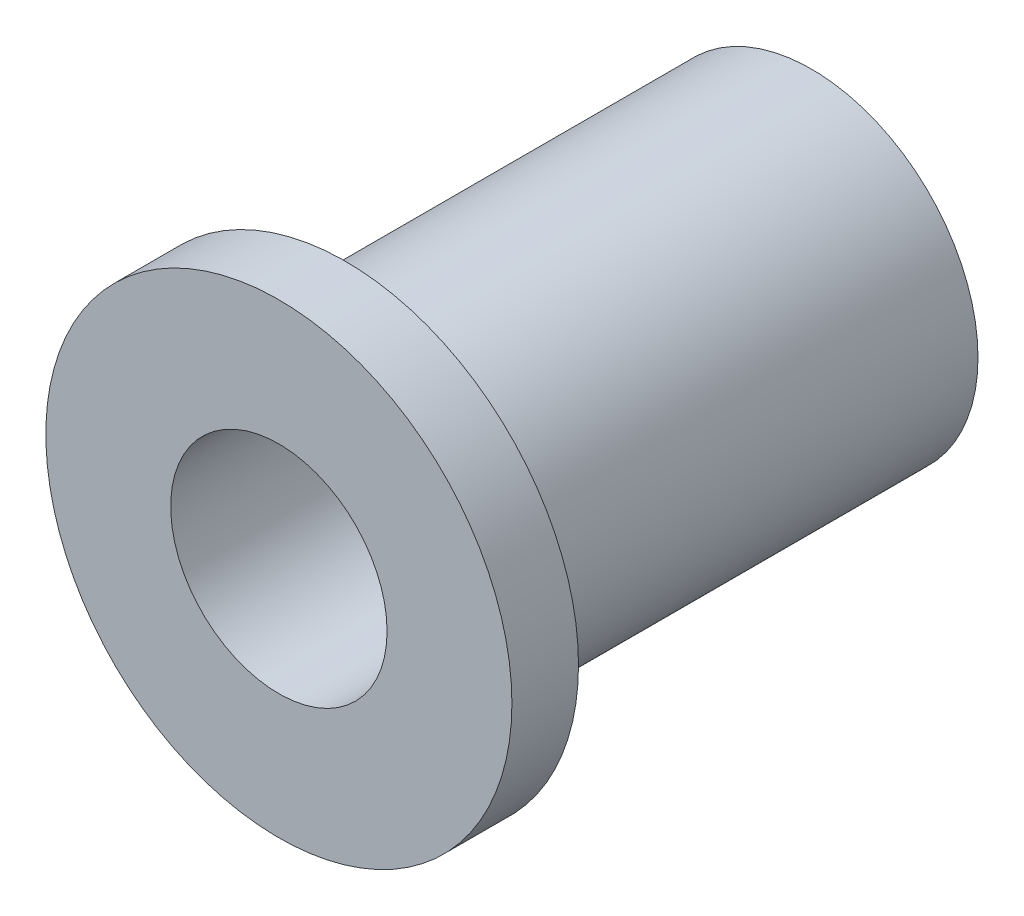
from build123d import *


with BuildPart() as part:
    # Esquisse1 → R_volution1 (revolve)
    with BuildSketch(Plane(origin=(0, 0, 0), x_dir=(0, 0, -1), z_dir=(1, 0, 0)), mode=Mode.PRIVATE) as r_volution1_sk:
        Polygon((0, 3.25), (16, 3.25), (16, 5), (2, 5), (2, 7), (0, 7), align=None)
    revolve(r_volution1_sk.sketch.rotate(Axis((0, 0, 0), (0, 0, -1)), 90), axis=Axis((0, 0, 0), (0, 0, -1)))


solid = part.part
